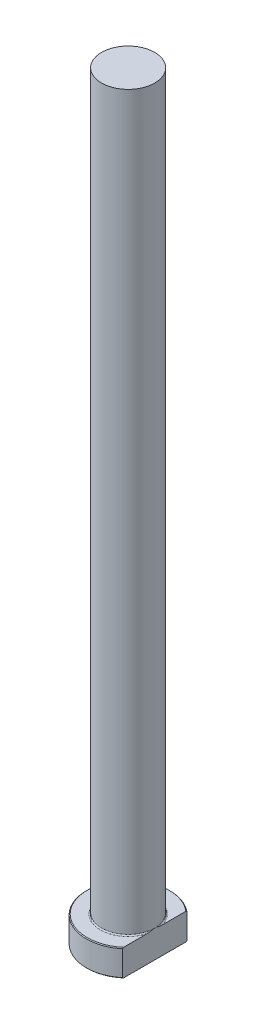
from build123d import *
from build123d.topology import SkipClean

# Parameters (mm, degrees)
CHAMFER1_SIZE = 0.2
FILLET1_R     = 0.3
KEY_DEPTH     = 201.604087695


with BuildPart() as part:
    # Sketch1 → Revolve1 (revolve)
    with BuildSketch(Plane.XY, mode=Mode.PRIVATE) as revolve1_sk:
        Polygon((0, 0), (-11, 0), (-11, 7), (-7, 7), (-7, 200), (0, 200), align=None)
    revolve(revolve1_sk.sketch.rotate(Axis((0, 259.958771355, 0), (0, -1, 0)), 270), axis=Axis((0, 259.958771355, 0), (0, -1, 0)))

    # Chamfer1
    chamfer1_edges = [part.edges().sort_by_distance(p)[0] for p in [
        (0, 7, -11),
        (0, 0, -11),
    ]]
    chamfer(chamfer1_edges, length=CHAMFER1_SIZE)

    # Fillet1
    fillet1_edges = [part.edges().sort_by_distance(p)[0] for p in [
        (0, 7, -7),
    ]]
    fillet(fillet1_edges, radius=FILLET1_R)

    # Sketch2 → KEY (cut, through all)
    with SkipClean():  # the faces are left unmerged after this step: merging them gives an invalid solid
        with BuildSketch(Plane(origin=(0, 0, 0), x_dir=(1, 0, 0), z_dir=(0, 1, 0))):
            with BuildLine():
                Line((7, 8.485281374), (7, -8.485281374))
                ThreePointArc((7, -8.485281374), (11, 0), (7, 8.485281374))
            make_face()
        extrude(amount=KEY_DEPTH, mode=Mode.SUBTRACT)


solid = part.part
